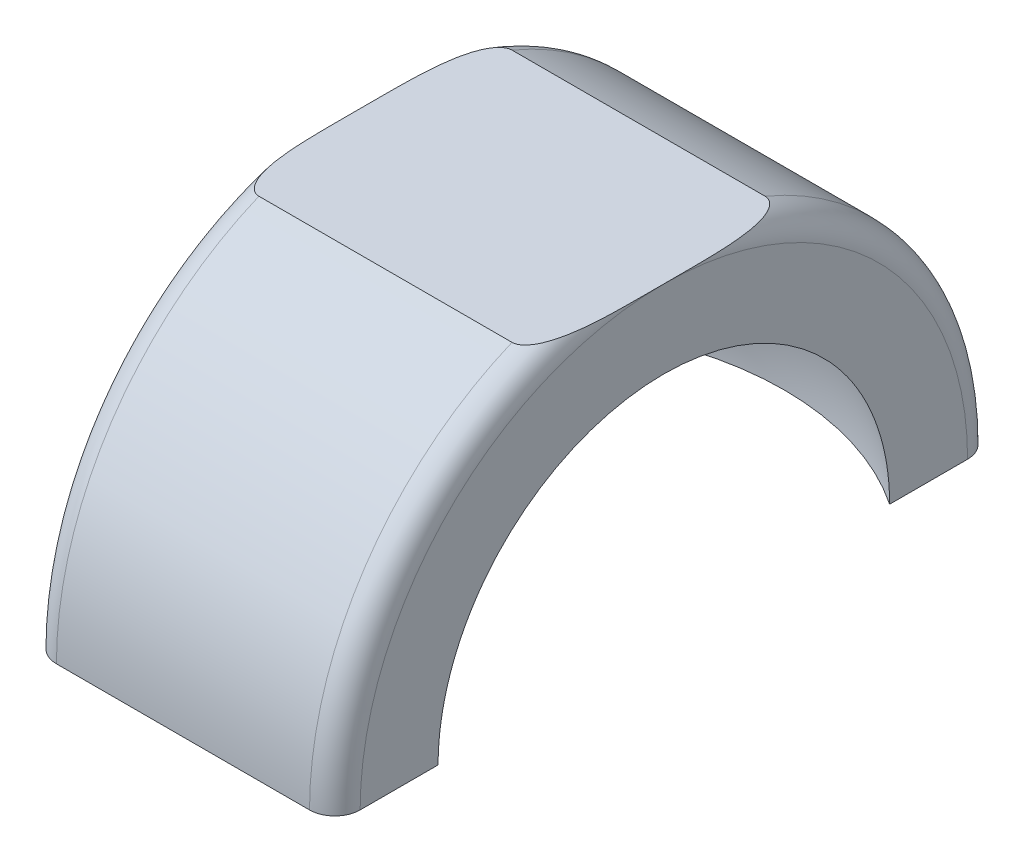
from build123d import *

# Parameters (mm, degrees)
BASE_R_VOLUTION_ANGLE   = 180
ESQUISSE2_W             = 44
ESQUISSE2_H             = 6
ENL_V_MAT_EXTRU_1_DEPTH = 44.908996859


with BuildPart() as part:
    # Esquisse1 → Base-R_volution (revolve, symmetric)
    with BuildSketch(Plane.XY) as base_r_volution_sk:
        with BuildLine():
            Line((-12, 17.839562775), (-12, 24))
            ThreePointArc((-12, 24), (-11.414213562, 25.414213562), (-10, 26))
            Line((-10, 26), (10, 26))
            ThreePointArc((10, 26), (11.414213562, 25.414213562), (12, 24))
            Line((12, 24), (12, 17.839562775))
            ThreePointArc((12, 17.839562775), (0, 21.5), (-12, 17.839562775))
        make_face()
    revolve(axis=Axis((-22, 0, 0), (1, 0, 0)), revolution_arc=BASE_R_VOLUTION_ANGLE / 2)
    revolve(base_r_volution_sk.sketch, axis=Axis((-22, 0, 0), (-1, 0, 0)), revolution_arc=BASE_R_VOLUTION_ANGLE / 2)

    # Esquisse2 → Enl_v. mat.-Extru.1 (cut, through all)
    with BuildSketch(Plane(origin=(12, 0, 0), x_dir=(0, 0, -1), z_dir=(1, 0, 0))):
        with Locations((0, 27)):
            Rectangle(ESQUISSE2_W, ESQUISSE2_H)
    extrude(amount=-ENL_V_MAT_EXTRU_1_DEPTH, mode=Mode.SUBTRACT)


solid = part.part
